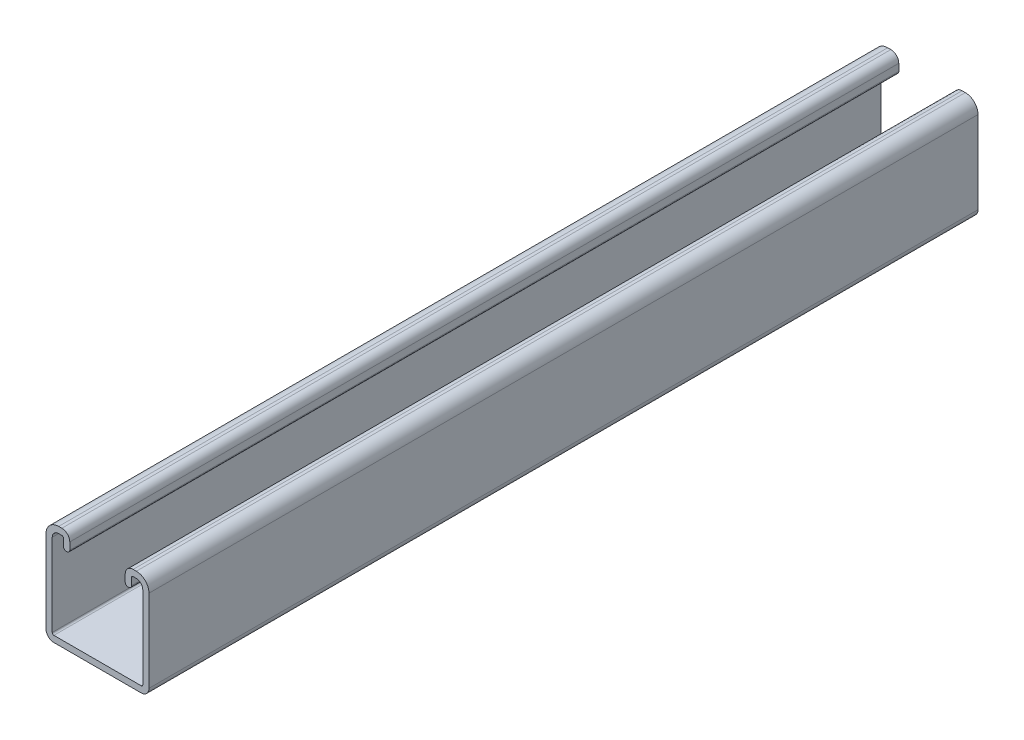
from build123d import *

# Parameters (mm, degrees)
BOSS_EXTRUDE1_DEPTH = 332.232
SKETCH3_R           = 2.54
CUT_EXTRUDE1_DEPTH  = 338.024076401
SKETCH4_R           = 2.54
CUT_EXTRUDE2_DEPTH  = 338.024076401


with BuildPart() as part:
    # Sketch1 → Boss-Extrude1 (new body)
    with BuildSketch(Plane.XY):
        with BuildLine():
            Line((5.08, 41.275), (6.35, 41.275))
            ThreePointArc((6.35, 41.275), (8.59506403, 40.34506403), (9.525, 38.1))
            Line((9.525, 38.1), (9.525, 35.27425))
            ThreePointArc((9.525, 35.27425), (9.190223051, 34.466026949), (8.382, 34.13125))
            Line((8.382, 34.13125), (8.168, 34.13125))
            ThreePointArc((8.168, 34.13125), (7.359776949, 34.466026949), (7.025, 35.27425))
            Line((7.025, 35.27425), (7.025, 38.1))
            ThreePointArc((7.025, 38.1), (6.827297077, 38.577297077), (6.35, 38.775))
            Line((6.35, 38.775), (5.08, 38.775))
            ThreePointArc((5.08, 38.775), (3.255664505, 38.019335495), (2.5, 36.195))
            Line((2.5, 36.195), (2.5, 3.175))
            ThreePointArc((2.5, 3.175), (2.697702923, 2.697702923), (3.175, 2.5))
            Line((3.175, 2.5), (38.1, 2.5))
            ThreePointArc((38.1, 2.5), (38.577297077, 2.697702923), (38.775, 3.175))
            Line((38.775, 3.175), (38.775, 36.195))
            ThreePointArc((38.775, 36.195), (38.019335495, 38.019335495), (36.195, 38.775))
            Line((36.195, 38.775), (34.925, 38.775))
            ThreePointArc((34.925, 38.775), (34.447702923, 38.577297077), (34.25, 38.1))
            Line((34.25, 38.1), (34.25, 35.27425))
            ThreePointArc((34.25, 35.27425), (33.915223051, 34.466026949), (33.107, 34.13125))
            Line((33.107, 34.13125), (32.893, 34.13125))
            ThreePointArc((32.893, 34.13125), (32.084776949, 34.466026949), (31.75, 35.27425))
            Line((31.75, 35.27425), (31.75, 38.1))
            ThreePointArc((31.75, 38.1), (32.67993597, 40.34506403), (34.925, 41.275))
            Line((34.925, 41.275), (36.195, 41.275))
            ThreePointArc((36.195, 41.275), (39.787102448, 39.787102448), (41.275, 36.195))
            Line((41.275, 36.195), (41.275, 3.175))
            ThreePointArc((41.275, 3.175), (40.34506403, 0.92993597), (38.1, 0))
            Line((38.1, 0), (3.175, 0))
            ThreePointArc((3.175, 0), (0.92993597, 0.92993597), (0, 3.175))
            Line((0, 3.175), (0, 36.195))
            ThreePointArc((0, 36.195), (1.487897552, 39.787102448), (5.08, 41.275))
        make_face()
    extrude(amount=BOSS_EXTRUDE1_DEPTH)

    # Sketch3 → Cut-Extrude1 (cut, through all)
    with BuildSketch(Plane(origin=(0, 2.5, 0), x_dir=(1, 0, 0), z_dir=(0, 1, 0))):
        with Locations(Location((20.6375, -50.8, 0), (0, 0, 270))):
            Circle(SKETCH3_R)
        with Locations(Location((20.6375, -127, 0), (0, 0, 270))):
            Circle(SKETCH3_R)
        with Locations(Location((20.6375, -203.2, 0), (0, 0, 270))):
            Circle(SKETCH3_R)
        with Locations((20.6375, -381)):
            Circle(SKETCH3_R)
        with Locations((20.6375, -482.6)):
            Circle(SKETCH3_R)
    extrude(amount=-CUT_EXTRUDE1_DEPTH, mode=Mode.SUBTRACT)

    # Sketch4 → Cut-Extrude2 (cut, through all)
    with BuildSketch(Plane(origin=(0, 2.5, 0), x_dir=(1, 0, 0), z_dir=(0, 1, 0))):
        with Locations(Location((20.6375, -272.693321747, 0), (0, 0, 270))):
            Circle(SKETCH4_R)
    extrude(amount=-CUT_EXTRUDE2_DEPTH, mode=Mode.SUBTRACT)


solid = part.part
